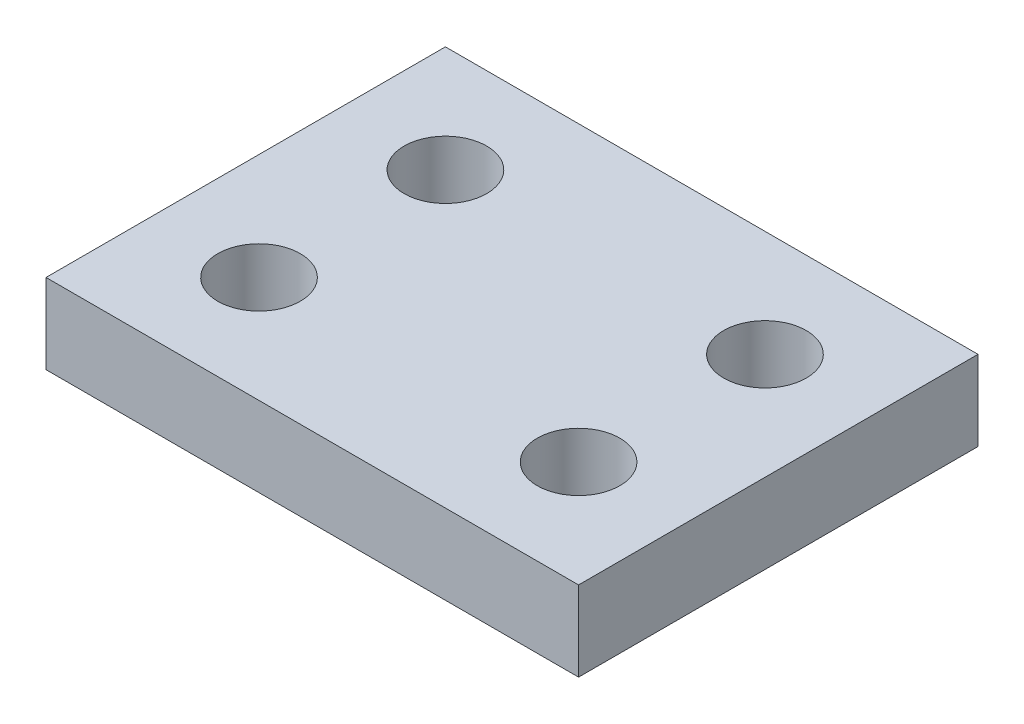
from build123d import *

# Parameters (mm, degrees)
SKETCH1_W                    = 100
SKETCH1_H                    = 75
BOSS_EXTRUDE1_DEPTH          = 15
F_15_5_15_5_DIAMETER_HOLE1_D = 15.5


with BuildPart() as part:
    # Sketch1 → Boss-Extrude1 (new body)
    with BuildSketch(Plane(origin=(0, 0, 0), x_dir=(1, 0, 0), z_dir=(0, 1, 0))):
        Rectangle(SKETCH1_W, SKETCH1_H)
    extrude(amount=BOSS_EXTRUDE1_DEPTH)

    # 15.5 _15.5_ Diameter Hole1 (through all)
    with Locations(Plane(origin=(0, 15, 0), x_dir=(-1, 0, 0), z_dir=(0, 1, 0))):
        with Locations((30, 17.5), (30, -17.5), (-30, -17.5), (-30, 17.5)):
            Hole(F_15_5_15_5_DIAMETER_HOLE1_D / 2)


solid = part.part
